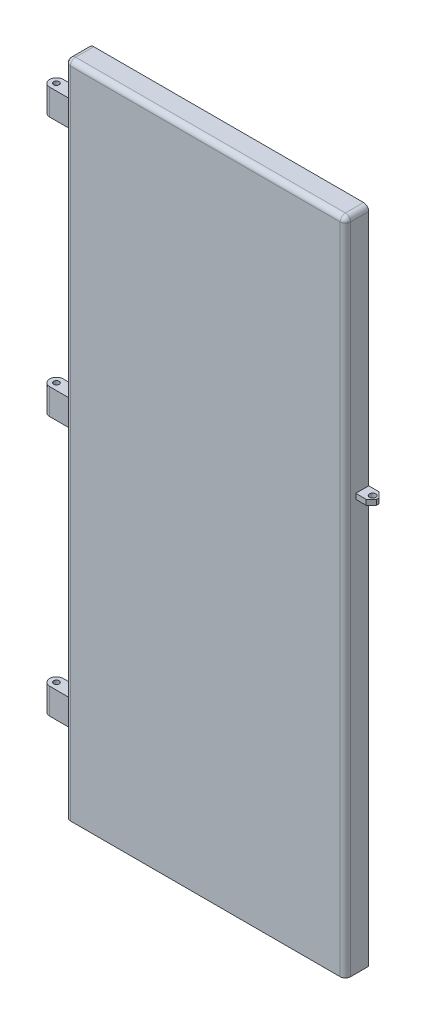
from build123d import *

# Parameters (mm, degrees)
ESQUISSE1_W                = 540
ESQUISSE1_H                = 1270
BOSS_EXTRU_1_DEPTH         = 45
CONG_1_R                   = 10
COQUE1_T                   = -2
ESQUISSE2_R                = 5.25
BOSS_EXTRU_2_DEPTH         = 50
R_P_TITION_LIN_AIRE1_COUNT = 3
R_P_TITION_LIN_AIRE1_PITCH = 500
ESQUISSE3_W                = 25
ESQUISSE3_H                = 10
BOSS_EXTRU_3_DEPTH         = 30
ESQUISSE4_R                = 6
ENL_V_MAT_EXTRU_1_DEPTH    = 10
CHANFREIN1_SIZE            = 10
ESQUISSE5_R                = 6
BOSS_EXTRU_4_DEPTH         = 531


with BuildPart() as part:
    # Esquisse1 → Boss.-Extru.1 (new body)
    with BuildSketch(Plane.XY):
        Rectangle(ESQUISSE1_W, ESQUISSE1_H)
    extrude(amount=BOSS_EXTRU_1_DEPTH)

    # Cong_1
    cong_1_edges = [part.edges().sort_by_distance(p)[0] for p in [
        (-270, 0, 45),
        (270, 0, 45),
        (0, 635, 45),
        (-270, 635, 22.5),
        (270, 635, 22.5),
    ]]
    fillet(cong_1_edges, radius=CONG_1_R)

    # Coque1
    coque1_openings = [part.faces().sort_by_distance(p)[0] for p in [
        (0, -0.039603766, 0),
        (0, -635, 22.464140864),
    ]]
    offset(amount=COQUE1_T, openings=coque1_openings, kind=Kind.INTERSECTION)

    # Esquisse2 → Boss.-Extru.2 (add)
    with BuildSketch(Plane(origin=(0, 560, 0), x_dir=(1, 0, 0), z_dir=(0, 1, 0))):
        with BuildLine():
            Line((-310, -35), (-270, -35))
            Line((-270, -35), (-270, -9))
            Line((-270, -9), (-310, -9))
            ThreePointArc((-310, -9), (-323, -22), (-310, -35))
        make_face()
        with Locations(Location((-310, -22, 0), (0, 0, 270))):
            Circle(ESQUISSE2_R, mode=Mode.SUBTRACT)
    boss_extru_2 = extrude(amount=-BOSS_EXTRU_2_DEPTH)

    # R_p_tition lin_aire1: Boss.-Extru.2 ×3
    with Locations(*[(0, -i * R_P_TITION_LIN_AIRE1_PITCH, 0) for i in range(1, R_P_TITION_LIN_AIRE1_COUNT)]):
        add(boss_extru_2)

    # Esquisse3 → Boss.-Extru.3 (add)
    with BuildSketch(Plane(origin=(270, 0, 0), x_dir=(0, 0, -1), z_dir=(1, 0, 0))):
        with Locations((-12.5, 162)):
            Rectangle(ESQUISSE3_W, ESQUISSE3_H)
    extrude(amount=BOSS_EXTRU_3_DEPTH)

    # Esquisse4 → Enl_v. mat.-Extru.1 (cut)
    with BuildSketch(Plane(origin=(0, 167, 0), x_dir=(1, 0, 0), z_dir=(0, 1, 0))):
        with Locations(Location((290, -12.5, 0), (0, 0, 270))):
            Circle(ESQUISSE4_R)
    extrude(amount=-ENL_V_MAT_EXTRU_1_DEPTH, mode=Mode.SUBTRACT)

    # Chanfrein1
    chanfrein1_edges = [part.edges().sort_by_distance(p)[0] for p in [
        (300, 162, 0),
        (300, 162, 25),
    ]]
    chamfer(chanfrein1_edges, length=CHANFREIN1_SIZE)

    # Esquisse5 → Boss.-Extru.4 (add)
    with BuildSketch(Plane.ZY.offset(-268)):
        with Locations((15, 415)):
            Circle(ESQUISSE5_R)
        with Locations((15, 65)):
            Circle(ESQUISSE5_R)
        with Locations((15, -285)):
            Circle(ESQUISSE5_R)
    extrude(amount=BOSS_EXTRU_4_DEPTH)


solid = part.part
